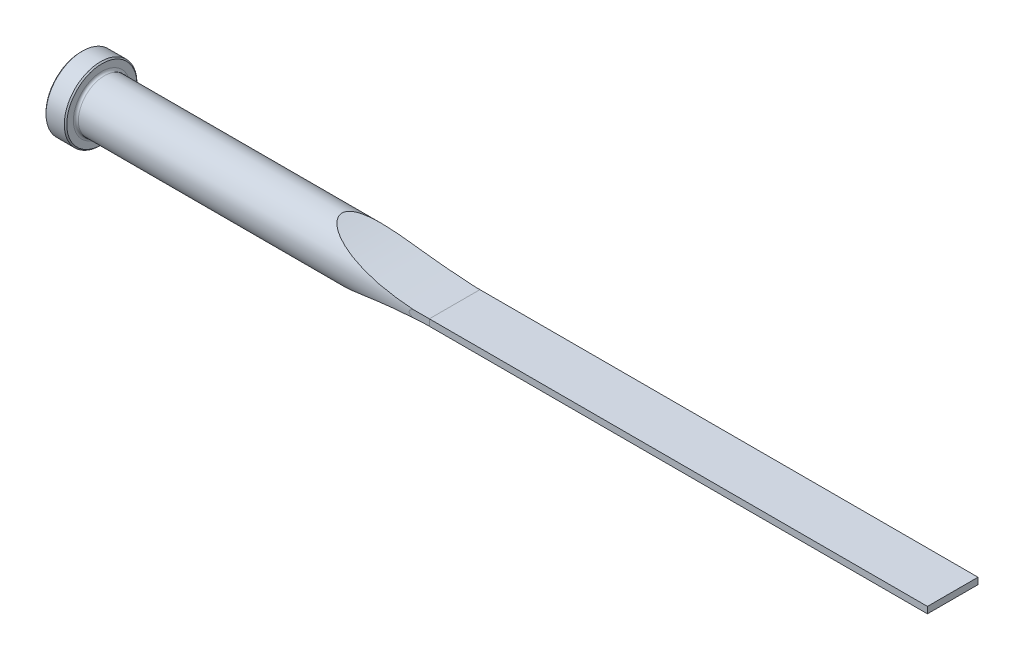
from build123d import *

# Parameters (mm, degrees)
CUT_EXTRUDE1_DEPTH = 268.162619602
CUT_EXTRUDE2_DEPTH = 268.162619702
FILLET1_R          = 0.762
CHAMFER1_SIZE      = 0.381


with BuildPart() as part:
    # Sketch1 → Revolve1 (revolve)
    with BuildSketch(Plane.XY, mode=Mode.PRIVATE) as revolve1_sk:
        Polygon((0, 0), (0, 11.1125), (6.35, 11.1125), (6.35, 7.9375), (266.7, 7.9375), (266.7, 0), align=None)
    revolve(revolve1_sk.sketch.rotate(Axis((0, 0, 0), (1, 0, 0)), 90), axis=Axis((0, 0, 0), (1, 0, 0)))

    # Sketch2 → Cut-Extrude1 (cut, symmetric)
    with BuildSketch(Plane.XY):
        with BuildLine():
            Line((266.7, 7.9375), (266.7, 0.9906))
            Line((266.7, 0.9906), (114.3, 0.9906))
            ThreePointArc((114.3, 0.9906), (96.727586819, 2.744628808), (79.848593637, 7.9375))
            Line((79.848593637, 7.9375), (266.7, 7.9375))
        make_face()
    cut_extrude1 = extrude(amount=CUT_EXTRUDE1_DEPTH, both=True, mode=Mode.SUBTRACT)

    # Mirror1: Cut-Extrude1 across plane
    add(cut_extrude1.mirror(Plane.ZX), mode=Mode.SUBTRACT)

    # Sketch3 → Cut-Extrude2 (cut, symmetric)
    with BuildSketch(Plane(origin=(0, 0, 0), x_dir=(1, 0, 0), z_dir=(0, 1, 0))):
        with BuildLine():
            Line((266.7, 7.9375), (266.7, 7.7343))
            Line((266.7, 7.7343), (114.3, 7.7343))
            ThreePointArc((114.3, 7.7343), (111.29463147, 7.785114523), (108.292698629, 7.9375))
            Line((108.292698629, 7.9375), (266.7, 7.9375))
        make_face()
    cut_extrude2 = extrude(amount=CUT_EXTRUDE2_DEPTH, both=True, mode=Mode.SUBTRACT)

    # Mirror2: Cut-Extrude2 across plane
    add(cut_extrude2.mirror(Plane.XY), mode=Mode.SUBTRACT)

    # Fillet1
    fillet1_edges = [part.edges().sort_by_distance(p)[0] for p in [
        (6.35, 0, -7.9375),
    ]]
    fillet(fillet1_edges, radius=FILLET1_R)

    # Chamfer1
    chamfer1_edges = [part.edges().sort_by_distance(p)[0] for p in [
        (6.35, 0, -11.1125),
        (0, 0, -11.1125),
    ]]
    chamfer(chamfer1_edges, length=CHAMFER1_SIZE)


solid = part.part
